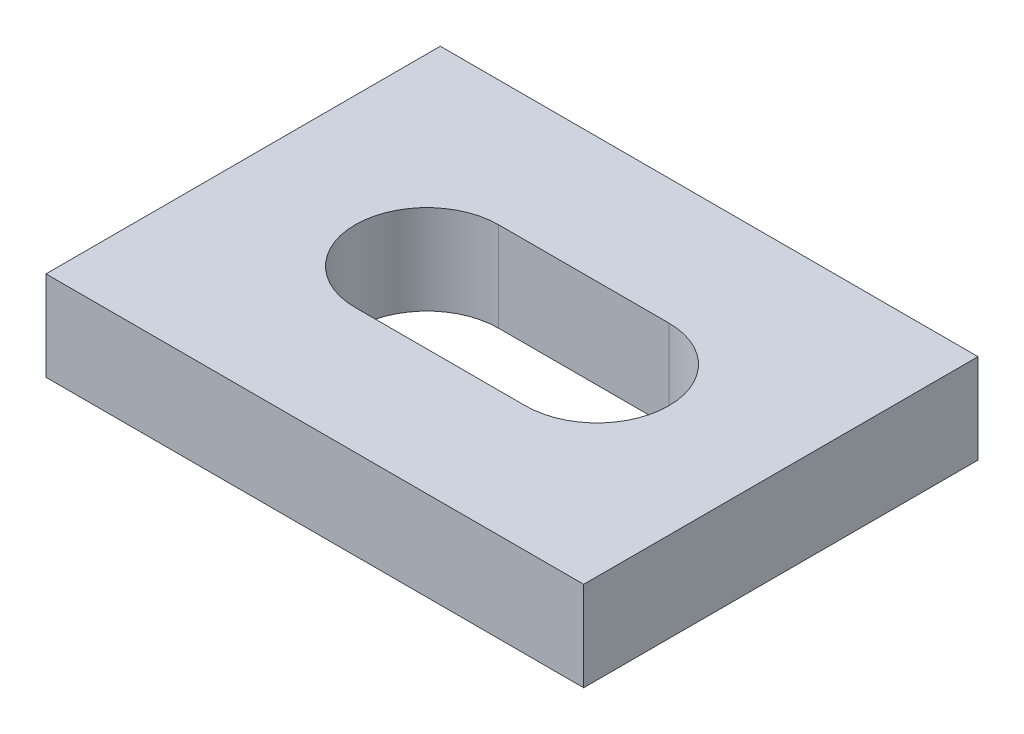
from build123d import *

# Parameters (mm, degrees)
ESQUISSE1_W             = 60
ESQUISSE1_H             = 44
EXTRUSION1_DEPTH        = 10
ENL_V_MAT_EXTRU_1_REACH = 75.565


with BuildPart() as part:
    # Esquisse1 → Extrusion1 (new body)
    with BuildSketch(Plane(origin=(0, 0, 0), x_dir=(1, 0, 0), z_dir=(0, 1, 0))):
        Rectangle(ESQUISSE1_W, ESQUISSE1_H)
    extrude(amount=EXTRUSION1_DEPTH)

    # Esquisse2 → Enl_v. mat.-Extru.1 (cut, up to next)
    with BuildSketch(Plane(origin=(-37.309719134, 10, 5.949360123), x_dir=(-1, 0, 0), z_dir=(0, 1, 0)), mode=Mode.PRIVATE) as enl_v_mat_extru_1_sk1:
        with BuildLine():
            Line((-46.809719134, -13.949360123), (-27.809719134, -13.949360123))
            ThreePointArc((-27.809719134, -13.949360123), (-19.809719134, -5.949360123), (-27.809719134, 2.050639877))
            Line((-27.809719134, 2.050639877), (-46.809719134, 2.050639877))
            ThreePointArc((-46.809719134, 2.050639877), (-54.809719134, -5.949360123), (-46.809719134, -13.949360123))
        make_face()
    enl_v_mat_extru_1_tool1 = extrude(enl_v_mat_extru_1_sk1.sketch, amount=-ENL_V_MAT_EXTRU_1_REACH, mode=Mode.PRIVATE) & part.part
    add(enl_v_mat_extru_1_tool1.solids().sort_by_distance((0, 10, 0))[0], mode=Mode.SUBTRACT)


solid = part.part
